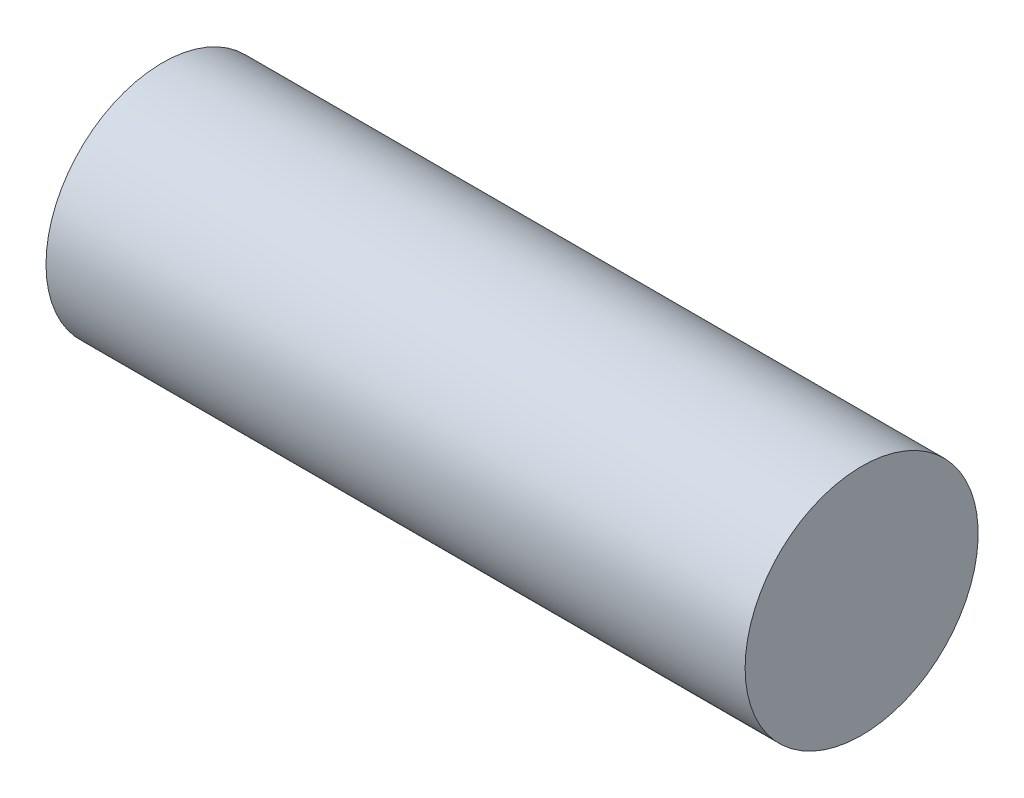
ISO-10303-21;
HEADER;
FILE_DESCRIPTION(('STEP AP214'),'2;1');
FILE_NAME('part.step','',(''),(''),'','','');
FILE_SCHEMA(('AUTOMOTIVE_DESIGN { 1 0 10303 214 1 1 1 1 }'));
ENDSEC;
DATA;
#1=APPLICATION_CONTEXT('core data for automotive mechanical design processes');
#2=APPLICATION_PROTOCOL_DEFINITION('international standard','automotive_design',2000,#1);
#3=PRODUCT_CONTEXT('',#1,'mechanical');
#4=PRODUCT('Part','Part','',(#3));
#5=PRODUCT_RELATED_PRODUCT_CATEGORY('part','',(#4));
#6=PRODUCT_DEFINITION_FORMATION('','',#4);
#7=PRODUCT_DEFINITION_CONTEXT('part definition',#1,'design');
#8=PRODUCT_DEFINITION('design','',#6,#7);
#9=PRODUCT_DEFINITION_SHAPE('','',#8);
#10=(LENGTH_UNIT() NAMED_UNIT(*) SI_UNIT(.MILLI.,.METRE.));
#11=(NAMED_UNIT(*) PLANE_ANGLE_UNIT() SI_UNIT($,.RADIAN.));
#12=(NAMED_UNIT(*) SI_UNIT($,.STERADIAN.) SOLID_ANGLE_UNIT());
#13=UNCERTAINTY_MEASURE_WITH_UNIT(LENGTH_MEASURE(1.E-05),#10,'distance_accuracy_value','');
#14=(GEOMETRIC_REPRESENTATION_CONTEXT(3) GLOBAL_UNCERTAINTY_ASSIGNED_CONTEXT((#13)) GLOBAL_UNIT_ASSIGNED_CONTEXT((#10,
#11,#12)) REPRESENTATION_CONTEXT('',''));
#15=CARTESIAN_POINT('',(0.,0.,0.));
#16=DIRECTION('',(0.,0.,1.));
#17=DIRECTION('',(1.,0.,0.));
#18=AXIS2_PLACEMENT_3D('',#15,#16,#17);
#19=CARTESIAN_POINT('',(45.,0.,0.));
#20=DIRECTION('',(-1.,0.,0.));
#21=DIRECTION('',(0.,0.,1.));
#22=AXIS2_PLACEMENT_3D('',#19,#20,#21);
#23=CYLINDRICAL_SURFACE('',#22,7.5);
#24=CARTESIAN_POINT('',(45.,0.,0.));
#25=DIRECTION('',(1.,0.,0.));
#26=DIRECTION('',(0.,0.,-1.));
#27=AXIS2_PLACEMENT_3D('',#24,#25,#26);
#28=CIRCLE('',#27,7.5);
#29=CARTESIAN_POINT('',(45.,0.,7.5));
#30=VERTEX_POINT('',#29);
#31=EDGE_CURVE('E10',#30,#30,#28,.T.);
#32=CARTESIAN_POINT('',(0.,0.,0.));
#33=DIRECTION('',(1.,0.,0.));
#34=DIRECTION('',(0.,0.,-1.));
#35=AXIS2_PLACEMENT_3D('',#32,#33,#34);
#36=CIRCLE('',#35,7.5);
#37=CARTESIAN_POINT('',(0.,0.,7.5));
#38=VERTEX_POINT('',#37);
#39=EDGE_CURVE('E40',#38,#38,#36,.T.);
#40=CARTESIAN_POINT('',(45.,0.,7.5));
#41=CARTESIAN_POINT('',(44.53125,0.,7.5));
#42=CARTESIAN_POINT('',(44.0625,0.,7.5));
#43=CARTESIAN_POINT('',(43.125,0.,7.5));
#44=CARTESIAN_POINT('',(42.65625,0.,7.5));
#45=CARTESIAN_POINT('',(41.71875,0.,7.5));
#46=CARTESIAN_POINT('',(41.25,0.,7.5));
#47=CARTESIAN_POINT('',(40.3125,0.,7.5));
#48=CARTESIAN_POINT('',(39.84375,0.,7.5));
#49=CARTESIAN_POINT('',(38.90625,0.,7.5));
#50=CARTESIAN_POINT('',(38.4375,0.,7.5));
#51=CARTESIAN_POINT('',(37.5,0.,7.5));
#52=CARTESIAN_POINT('',(37.03125,0.,7.5));
#53=CARTESIAN_POINT('',(36.09375,0.,7.5));
#54=CARTESIAN_POINT('',(35.625,0.,7.5));
#55=CARTESIAN_POINT('',(34.6875,0.,7.5));
#56=CARTESIAN_POINT('',(34.21875,0.,7.5));
#57=CARTESIAN_POINT('',(33.28125,0.,7.5));
#58=CARTESIAN_POINT('',(32.8125,0.,7.5));
#59=CARTESIAN_POINT('',(31.875,0.,7.5));
#60=CARTESIAN_POINT('',(31.40625,0.,7.5));
#61=CARTESIAN_POINT('',(30.46875,0.,7.5));
#62=CARTESIAN_POINT('',(30.,0.,7.5));
#63=CARTESIAN_POINT('',(29.0625,0.,7.5));
#64=CARTESIAN_POINT('',(28.59375,0.,7.5));
#65=CARTESIAN_POINT('',(27.65625,0.,7.5));
#66=CARTESIAN_POINT('',(27.1875,0.,7.5));
#67=CARTESIAN_POINT('',(26.25,0.,7.5));
#68=CARTESIAN_POINT('',(25.78125,0.,7.5));
#69=CARTESIAN_POINT('',(24.84375,0.,7.5));
#70=CARTESIAN_POINT('',(24.375,0.,7.5));
#71=CARTESIAN_POINT('',(23.4375,0.,7.5));
#72=CARTESIAN_POINT('',(22.96875,0.,7.5));
#73=CARTESIAN_POINT('',(22.03125,0.,7.5));
#74=CARTESIAN_POINT('',(21.5625,0.,7.5));
#75=CARTESIAN_POINT('',(20.625,0.,7.5));
#76=CARTESIAN_POINT('',(20.15625,0.,7.5));
#77=CARTESIAN_POINT('',(19.21875,0.,7.5));
#78=CARTESIAN_POINT('',(18.75,0.,7.5));
#79=CARTESIAN_POINT('',(17.8125,0.,7.5));
#80=CARTESIAN_POINT('',(17.34375,0.,7.5));
#81=CARTESIAN_POINT('',(16.40625,0.,7.5));
#82=CARTESIAN_POINT('',(15.9375,0.,7.5));
#83=CARTESIAN_POINT('',(15.,0.,7.5));
#84=CARTESIAN_POINT('',(14.53125,0.,7.5));
#85=CARTESIAN_POINT('',(13.59375,0.,7.5));
#86=CARTESIAN_POINT('',(13.125,0.,7.5));
#87=CARTESIAN_POINT('',(12.1875,0.,7.5));
#88=CARTESIAN_POINT('',(11.71875,0.,7.5));
#89=CARTESIAN_POINT('',(10.78125,0.,7.5));
#90=CARTESIAN_POINT('',(10.3125,0.,7.5));
#91=CARTESIAN_POINT('',(9.37499999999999,0.,7.5));
#92=CARTESIAN_POINT('',(8.90624999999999,0.,7.5));
#93=CARTESIAN_POINT('',(7.96874999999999,0.,7.5));
#94=CARTESIAN_POINT('',(7.5,0.,7.5));
#95=CARTESIAN_POINT('',(6.56249999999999,0.,7.5));
#96=CARTESIAN_POINT('',(6.09374999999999,0.,7.5));
#97=CARTESIAN_POINT('',(5.15624999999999,0.,7.5));
#98=CARTESIAN_POINT('',(4.68749999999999,0.,7.5));
#99=CARTESIAN_POINT('',(3.74999999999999,0.,7.5));
#100=CARTESIAN_POINT('',(3.28124999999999,0.,7.5));
#101=CARTESIAN_POINT('',(2.34374999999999,0.,7.5));
#102=CARTESIAN_POINT('',(1.87499999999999,0.,7.5));
#103=CARTESIAN_POINT('',(0.937499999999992,0.,7.5));
#104=CARTESIAN_POINT('',(0.468749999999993,0.,7.5));
#105=CARTESIAN_POINT('',(0.,0.,7.5));
#106=B_SPLINE_CURVE_WITH_KNOTS('',3,(#40,#41,#42,#43,#44,#45,#46,#47,#48,#49,#50,#51,#52,#53,
#54,#55,#56,#57,#58,#59,#60,#61,#62,#63,#64,#65,#66,#67,#68,#69,#70,#71,#72,#73,#74,#75,#76,#77,
#78,#79,#80,#81,#82,#83,#84,#85,#86,#87,#88,#89,#90,#91,#92,#93,#94,#95,#96,#97,#98,#99,#100,
#101,#102,#103,#104,#105),.UNSPECIFIED.,.F.,.F.,(4,2,2,2,2,2,2,2,2,2,2,2,2,2,2,2,2,2,2,2,2,2,2,
2,2,2,2,2,2,2,2,2,4),(0.,1.40625,2.8125,4.21874999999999,5.625,7.03125,8.43749999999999,9.84375,
11.25,12.65625,14.0625,15.46875,16.875,18.28125,19.6875,21.09375,22.5,23.90625,25.3125,26.71875,
28.125,29.53125,30.9375,32.34375,33.75,35.15625,36.5625,37.96875,39.375,40.78125,42.1875,
43.59375,45.),.UNSPECIFIED.);
#107=EDGE_CURVE('BSEAM37',#30,#38,#106,.T.);
#108=ORIENTED_EDGE('',*,*,#31,.F.);
#109=ORIENTED_EDGE('',*,*,#39,.T.);
#110=ORIENTED_EDGE('',*,*,#107,.T.);
#111=ORIENTED_EDGE('',*,*,#107,.F.);
#112=EDGE_LOOP('',(#108,#110,#109,#111));
#113=FACE_BOUND('',#112,.T.);
#114=ADVANCED_FACE('F37',(#113),#23,.T.);
#115=CARTESIAN_POINT('',(45.,0.,0.));
#116=DIRECTION('',(1.,0.,0.));
#117=DIRECTION('',(0.,0.,-1.));
#118=AXIS2_PLACEMENT_3D('',#115,#116,#117);
#119=PLANE('',#118);
#120=ORIENTED_EDGE('',*,*,#31,.T.);
#121=EDGE_LOOP('',(#120));
#122=FACE_BOUND('',#121,.T.);
#123=ADVANCED_FACE('F52',(#122),#119,.T.);
#124=CARTESIAN_POINT('',(0.,0.,0.));
#125=DIRECTION('',(1.,0.,0.));
#126=DIRECTION('',(0.,0.,-1.));
#127=AXIS2_PLACEMENT_3D('',#124,#125,#126);
#128=PLANE('',#127);
#129=ORIENTED_EDGE('',*,*,#39,.F.);
#130=EDGE_LOOP('',(#129));
#131=FACE_BOUND('',#130,.T.);
#132=ADVANCED_FACE('F50',(#131),#128,.F.);
#133=CLOSED_SHELL('',(#114,#123,#132));
#134=MANIFOLD_SOLID_BREP('B2',#133);
#135=ADVANCED_BREP_SHAPE_REPRESENTATION('',(#18,#134),#14);
#136=SHAPE_DEFINITION_REPRESENTATION(#9,#135);
ENDSEC;
END-ISO-10303-21;
